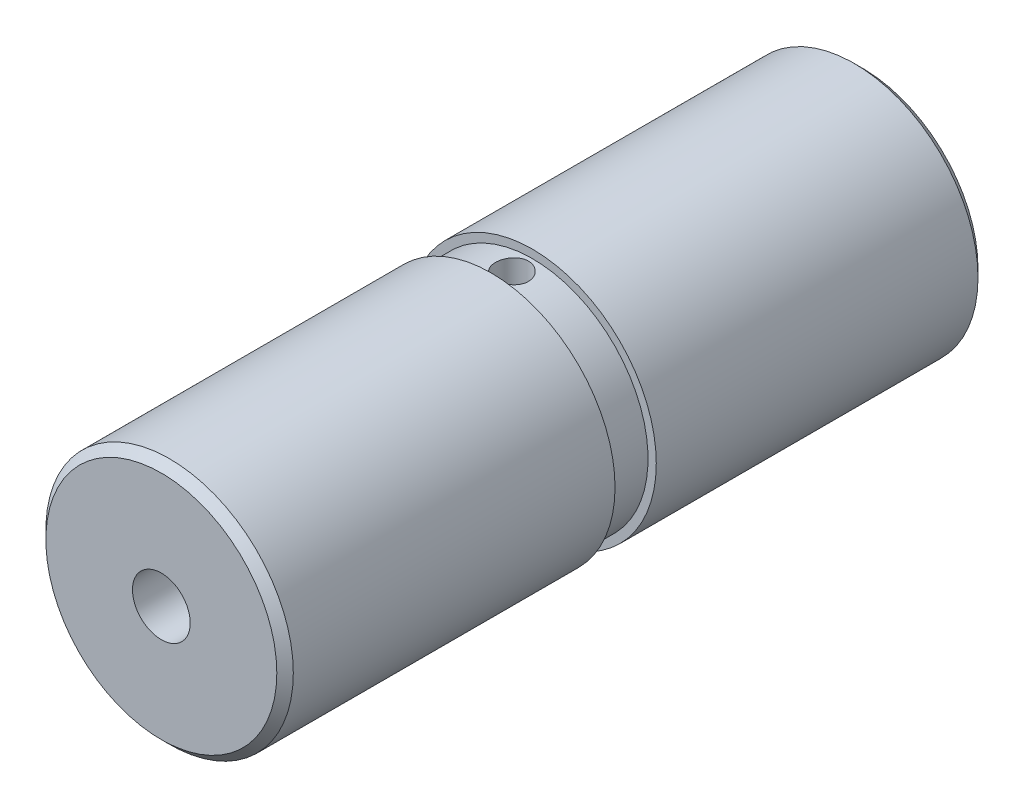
from build123d import *

# Parameters (mm, degrees)
SCHIZZO1_R                            = 15
ESTRUSIONE1_DEPTH                     = 85
SMUSSO1_SIZE                          = 1
F_4_0_4_FORO_DIAMETRALE1_D            = 4
M8X1_0_FORO_FILETTATO_PROFONDO1_D     = 7
M8X1_0_FORO_FILETTATO_PROFONDO1_DEPTH = 21
M8X1_0_FORO_FILETTATO_PROFONDO1_TIP   = 2.103012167
M8X1_0_FORO_FILETTATO_PROFONDO2_D     = 7
M8X1_0_FORO_FILETTATO_PROFONDO2_DEPTH = 21
M8X1_0_FORO_FILETTATO_PROFONDO2_TIP   = 2.103012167
SCHIZZO8_W                            = 2
SCHIZZO8_H                            = 15
SCHIZZO10_W                           = 1
SCHIZZO10_H                           = 5


with BuildPart() as part:
    # Schizzo1 → Estrusione1 (new body)
    with BuildSketch(Plane.XY):
        Circle(SCHIZZO1_R)
    extrude(amount=-ESTRUSIONE1_DEPTH)

    # Smusso1
    smusso1_edges = [part.edges().sort_by_distance(p)[0] for p in [
        (-15, 0, 0),
        (-15, 0, -85),
    ]]
    chamfer(smusso1_edges, length=SMUSSO1_SIZE)

    # 4.0 _4_ Foro diametrale1 (through all)
    with Locations(Plane.XY):
        with Locations((0, 0)):
            Hole(F_4_0_4_FORO_DIAMETRALE1_D / 2)

    # M8x1.0 Foro filettato profondo1
    with Locations(Plane.XY):
        with Locations((0, 0)):
            Hole(M8X1_0_FORO_FILETTATO_PROFONDO1_D / 2, depth=M8X1_0_FORO_FILETTATO_PROFONDO1_DEPTH)
            with Locations((0, 0, -(M8X1_0_FORO_FILETTATO_PROFONDO1_DEPTH + M8X1_0_FORO_FILETTATO_PROFONDO1_TIP / 2))):  # 118° drill point
                Cone(0, M8X1_0_FORO_FILETTATO_PROFONDO1_D / 2, M8X1_0_FORO_FILETTATO_PROFONDO1_TIP, mode=Mode.SUBTRACT)

    # M8x1.0 Foro filettato profondo2
    with Locations(Plane(origin=(0, 0, -85), x_dir=(-1, 0, 0), z_dir=(0, 0, -1))):
        with Locations((0, 0)):
            Hole(M8X1_0_FORO_FILETTATO_PROFONDO2_D / 2, depth=M8X1_0_FORO_FILETTATO_PROFONDO2_DEPTH)
            with Locations((0, 0, -(M8X1_0_FORO_FILETTATO_PROFONDO2_DEPTH + M8X1_0_FORO_FILETTATO_PROFONDO2_TIP / 2))):  # 118° drill point
                Cone(0, M8X1_0_FORO_FILETTATO_PROFONDO2_D / 2, M8X1_0_FORO_FILETTATO_PROFONDO2_TIP, mode=Mode.SUBTRACT)

    # Schizzo8 → 4.0 _4_ Foro diametrale2 (revolve, cut)
    with BuildSketch(Plane(origin=(0, 0, -42.5), x_dir=(0, 0, -1), z_dir=(1, 0, 0))):
        with Locations((1, 7.5)):
            Rectangle(SCHIZZO8_W, SCHIZZO8_H)
    revolve(axis=Axis((0, -6.35, -42.5), (0, 1, 0)), mode=Mode.SUBTRACT)

    # Schizzo10 → Taglia-Rivoluzione1 (revolve, cut)
    with BuildSketch(Plane(origin=(0, 0, 0), x_dir=(1, 0, 0), z_dir=(0, 1, 0))):
        with Locations((14.5, 42.5)):
            Rectangle(SCHIZZO10_W, SCHIZZO10_H)
    revolve(axis=Axis((0, 0, -85), (0, 0, 1)), mode=Mode.SUBTRACT)


solid = part.part
